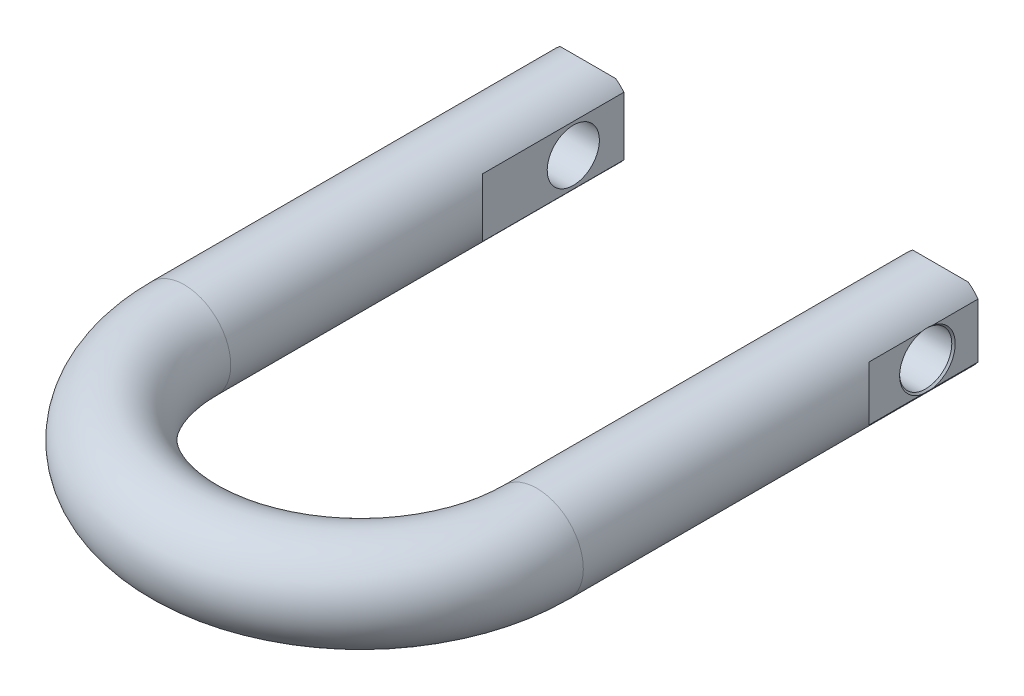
ISO-10303-21;
HEADER;
FILE_DESCRIPTION(('STEP AP214'),'2;1');
FILE_NAME('part.step','',(''),(''),'','','');
FILE_SCHEMA(('AUTOMOTIVE_DESIGN { 1 0 10303 214 1 1 1 1 }'));
ENDSEC;
DATA;
#1=APPLICATION_CONTEXT('core data for automotive mechanical design processes');
#2=APPLICATION_PROTOCOL_DEFINITION('international standard','automotive_design',2000,#1);
#3=PRODUCT_CONTEXT('',#1,'mechanical');
#4=PRODUCT('Part','Part','',(#3));
#5=PRODUCT_RELATED_PRODUCT_CATEGORY('part','',(#4));
#6=PRODUCT_DEFINITION_FORMATION('','',#4);
#7=PRODUCT_DEFINITION_CONTEXT('part definition',#1,'design');
#8=PRODUCT_DEFINITION('design','',#6,#7);
#9=PRODUCT_DEFINITION_SHAPE('','',#8);
#10=(LENGTH_UNIT() NAMED_UNIT(*) SI_UNIT(.MILLI.,.METRE.));
#11=(NAMED_UNIT(*) PLANE_ANGLE_UNIT() SI_UNIT($,.RADIAN.));
#12=(NAMED_UNIT(*) SI_UNIT($,.STERADIAN.) SOLID_ANGLE_UNIT());
#13=UNCERTAINTY_MEASURE_WITH_UNIT(LENGTH_MEASURE(1.E-05),#10,'distance_accuracy_value','');
#14=(GEOMETRIC_REPRESENTATION_CONTEXT(3) GLOBAL_UNCERTAINTY_ASSIGNED_CONTEXT((#13)) GLOBAL_UNIT_ASSIGNED_CONTEXT((#10,
#11,#12)) REPRESENTATION_CONTEXT('',''));
#15=CARTESIAN_POINT('',(0.,0.,0.));
#16=DIRECTION('',(0.,0.,1.));
#17=DIRECTION('',(1.,0.,0.));
#18=AXIS2_PLACEMENT_3D('',#15,#16,#17);
#19=CARTESIAN_POINT('',(72.58685,0.,0.));
#20=DIRECTION('',(-1.,0.,0.));
#21=DIRECTION('',(0.,-1.,0.));
#22=AXIS2_PLACEMENT_3D('',#19,#20,#21);
#23=CYLINDRICAL_SURFACE('',#22,8.9281);
#24=CARTESIAN_POINT('',(48.0314,0.,0.));
#25=DIRECTION('',(-1.,0.,0.));
#26=DIRECTION('',(0.,-1.,0.));
#27=AXIS2_PLACEMENT_3D('',#24,#25,#26);
#28=CIRCLE('',#27,8.9281);
#29=CARTESIAN_POINT('',(48.0314,-8.9281,0.));
#30=VERTEX_POINT('',#29);
#31=EDGE_CURVE('E18',#30,#30,#28,.T.);
#32=ORIENTED_EDGE('',*,*,#31,.T.);
#33=EDGE_LOOP('',(#32));
#34=FACE_BOUND('',#33,.T.);
#35=CARTESIAN_POINT('',(72.58685,0.,0.));
#36=DIRECTION('',(1.,0.,0.));
#37=DIRECTION('',(0.,0.,-1.));
#38=AXIS2_PLACEMENT_3D('',#35,#36,#37);
#39=CIRCLE('',#38,8.9281);
#40=CARTESIAN_POINT('',(72.58685,0.,-8.9281));
#41=VERTEX_POINT('',#40);
#42=EDGE_CURVE('E233',#41,#41,#39,.F.);
#43=ORIENTED_EDGE('',*,*,#42,.F.);
#44=EDGE_LOOP('',(#43));
#45=FACE_BOUND('',#44,.T.);
#46=ADVANCED_FACE('F14',(#34,#45),#23,.F.);
#47=CARTESIAN_POINT('',(-48.0314,0.,0.));
#48=DIRECTION('',(-1.,0.,0.));
#49=DIRECTION('',(0.,-1.,0.));
#50=AXIS2_PLACEMENT_3D('',#47,#48,#49);
#51=CYLINDRICAL_SURFACE('',#50,8.9281);
#52=CARTESIAN_POINT('',(-72.58685,0.,0.));
#53=DIRECTION('',(-1.,0.,0.));
#54=DIRECTION('',(0.,-1.,0.));
#55=AXIS2_PLACEMENT_3D('',#52,#53,#54);
#56=CIRCLE('',#55,8.9281);
#57=CARTESIAN_POINT('',(-72.58685,-8.9281,0.));
#58=VERTEX_POINT('',#57);
#59=EDGE_CURVE('E235',#58,#58,#56,.F.);
#60=ORIENTED_EDGE('',*,*,#59,.F.);
#61=EDGE_LOOP('',(#60));
#62=FACE_BOUND('',#61,.T.);
#63=CARTESIAN_POINT('',(-48.0314,0.,0.));
#64=DIRECTION('',(-1.,0.,0.));
#65=DIRECTION('',(0.,-1.,0.));
#66=AXIS2_PLACEMENT_3D('',#63,#64,#65);
#67=CIRCLE('',#66,8.9281);
#68=CARTESIAN_POINT('',(-48.0314,-8.9281,0.));
#69=VERTEX_POINT('',#68);
#70=EDGE_CURVE('E145',#69,#69,#67,.F.);
#71=ORIENTED_EDGE('',*,*,#70,.T.);
#72=EDGE_LOOP('',(#71));
#73=FACE_BOUND('',#72,.T.);
#74=ADVANCED_FACE('F157',(#62,#73),#51,.F.);
#75=CARTESIAN_POINT('',(0.,0.,120.8151));
#76=DIRECTION('',(0.,-1.,0.));
#77=DIRECTION('',(1.,0.,0.));
#78=AXIS2_PLACEMENT_3D('',#75,#76,#77);
#79=TOROIDAL_SURFACE('',#78,60.3377,15.875);
#80=CARTESIAN_POINT('',(-60.3377,0.,120.8151));
#81=DIRECTION('',(0.,0.,1.));
#82=DIRECTION('',(0.,1.,0.));
#83=AXIS2_PLACEMENT_3D('',#80,#81,#82);
#84=CIRCLE('',#83,15.875);
#85=CARTESIAN_POINT('',(-60.3377,15.875,120.8151));
#86=VERTEX_POINT('',#85);
#87=EDGE_CURVE('E262',#86,#86,#84,.T.);
#88=ORIENTED_EDGE('',*,*,#87,.T.);
#89=EDGE_LOOP('',(#88));
#90=FACE_BOUND('',#89,.T.);
#91=CARTESIAN_POINT('',(60.3377,0.,120.8151));
#92=DIRECTION('',(0.,0.,1.));
#93=DIRECTION('',(0.,1.,0.));
#94=AXIS2_PLACEMENT_3D('',#91,#92,#93);
#95=CIRCLE('',#94,15.875);
#96=CARTESIAN_POINT('',(60.3377,15.875,120.8151));
#97=VERTEX_POINT('',#96);
#98=EDGE_CURVE('E266',#97,#97,#95,.T.);
#99=ORIENTED_EDGE('',*,*,#98,.T.);
#100=EDGE_LOOP('',(#99));
#101=FACE_BOUND('',#100,.T.);
#102=ADVANCED_FACE('F16',(#90,#101),#79,.T.);
#103=CARTESIAN_POINT('',(-50.6984,12.7,-17.3101));
#104=DIRECTION('',(0.,-0.707106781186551,0.707106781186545));
#105=DIRECTION('',(0.,0.707106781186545,0.70710678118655));
#106=AXIS2_PLACEMENT_3D('',#103,#104,#105);
#107=PLANE('',#106);
#108=DIRECTION('',(-1.,0.,0.));
#109=VECTOR('',#108,1.);
#110=CARTESIAN_POINT('',(-60.6044,12.7,-17.3101));
#111=LINE('',#110,#109);
#112=CARTESIAN_POINT('',(-50.8127,12.7,-17.3101));
#113=VERTEX_POINT('',#112);
#114=CARTESIAN_POINT('',(-69.8627,12.7,-17.3101));
#115=VERTEX_POINT('',#114);
#116=EDGE_CURVE('E243',#113,#115,#111,.T.);
#117=ORIENTED_EDGE('',*,*,#116,.T.);
#118=CARTESIAN_POINT('',(-60.3377,0.,-30.0101));
#119=DIRECTION('',(0.,-0.707106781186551,0.707106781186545));
#120=DIRECTION('',(0.,-0.707106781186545,-0.707106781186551));
#121=AXIS2_PLACEMENT_3D('',#118,#119,#120);
#122=ELLIPSE('',#121,22.450640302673,15.875);
#123=EDGE_CURVE('E289',#115,#113,#122,.F.);
#124=ORIENTED_EDGE('',*,*,#123,.T.);
#125=EDGE_LOOP('',(#117,#124));
#126=FACE_BOUND('',#125,.T.);
#127=ADVANCED_FACE('F370',(#126),#107,.F.);
#128=CARTESIAN_POINT('',(-48.0314,-10.1488315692,31.1023));
#129=DIRECTION('',(-0.707106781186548,0.,0.707106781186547));
#130=DIRECTION('',(0.707106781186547,0.,0.707106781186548));
#131=AXIS2_PLACEMENT_3D('',#128,#129,#130);
#132=PLANE('',#131);
#133=DIRECTION('',(0.,-1.,0.));
#134=VECTOR('',#133,1.);
#135=CARTESIAN_POINT('',(-48.0314,0.,31.1023));
#136=LINE('',#135,#134);
#137=CARTESIAN_POINT('',(-48.0314000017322,10.0284896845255,31.1022999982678));
#138=VERTEX_POINT('',#137);
#139=CARTESIAN_POINT('',(-48.0314000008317,-10.0284896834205,31.1022999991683));
#140=VERTEX_POINT('',#139);
#141=EDGE_CURVE('E144',#138,#140,#136,.T.);
#142=ORIENTED_EDGE('',*,*,#141,.F.);
#143=CARTESIAN_POINT('',(-60.3377,0.,18.796));
#144=DIRECTION('',(-0.707106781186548,0.,0.707106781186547));
#145=DIRECTION('',(-0.707106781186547,0.,-0.707106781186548));
#146=AXIS2_PLACEMENT_3D('',#143,#144,#145);
#147=ELLIPSE('',#146,22.4506403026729,15.875);
#148=EDGE_CURVE('E255',#138,#140,#147,.F.);
#149=ORIENTED_EDGE('',*,*,#148,.T.);
#150=EDGE_LOOP('',(#142,#149));
#151=FACE_BOUND('',#150,.T.);
#152=ADVANCED_FACE('F377',(#151),#132,.F.);
#153=CARTESIAN_POINT('',(-48.0314,-10.0284896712,-17.3101));
#154=DIRECTION('',(-1.,0.,0.));
#155=DIRECTION('',(0.,0.,1.));
#156=AXIS2_PLACEMENT_3D('',#153,#154,#155);
#157=PLANE('',#156);
#158=ORIENTED_EDGE('',*,*,#70,.F.);
#159=EDGE_LOOP('',(#158));
#160=FACE_BOUND('',#159,.T.);
#161=DIRECTION('',(0.,-1.,0.));
#162=VECTOR('',#161,1.);
#163=CARTESIAN_POINT('',(-48.0314,0.,-17.3101));
#164=LINE('',#163,#162);
#165=CARTESIAN_POINT('',(-48.0314000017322,10.0284896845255,-17.3101));
#166=VERTEX_POINT('',#165);
#167=CARTESIAN_POINT('',(-48.0314000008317,-10.0284896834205,-17.3101));
#168=VERTEX_POINT('',#167);
#169=EDGE_CURVE('E245',#166,#168,#164,.T.);
#170=ORIENTED_EDGE('',*,*,#169,.F.);
#171=DIRECTION('',(0.,0.,-1.));
#172=VECTOR('',#171,1.);
#173=CARTESIAN_POINT('',(-48.0314000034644,10.0284896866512,51.7525));
#174=LINE('',#173,#172);
#175=EDGE_CURVE('E253',#166,#138,#174,.F.);
#176=ORIENTED_EDGE('',*,*,#175,.T.);
#177=ORIENTED_EDGE('',*,*,#141,.T.);
#178=DIRECTION('',(0.,0.,1.));
#179=VECTOR('',#178,1.);
#180=CARTESIAN_POINT('',(-48.0314000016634,-10.0284896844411,51.7525));
#181=LINE('',#180,#179);
#182=EDGE_CURVE('E278',#140,#168,#181,.F.);
#183=ORIENTED_EDGE('',*,*,#182,.T.);
#184=EDGE_LOOP('',(#170,#176,#177,#183));
#185=FACE_BOUND('',#184,.T.);
#186=ADVANCED_FACE('F307',(#160,#185),#157,.F.);
#187=CARTESIAN_POINT('',(-50.6984,-15.89405,-14.11605));
#188=DIRECTION('',(0.,0.707106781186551,0.707106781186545));
#189=DIRECTION('',(0.,0.707106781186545,-0.70710678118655));
#190=AXIS2_PLACEMENT_3D('',#187,#188,#189);
#191=PLANE('',#190);
#192=DIRECTION('',(1.,0.,0.));
#193=VECTOR('',#192,1.);
#194=CARTESIAN_POINT('',(-60.6044,-12.7,-17.3101));
#195=LINE('',#194,#193);
#196=CARTESIAN_POINT('',(-69.8627,-12.7,-17.3101));
#197=VERTEX_POINT('',#196);
#198=CARTESIAN_POINT('',(-50.8127,-12.7,-17.3101));
#199=VERTEX_POINT('',#198);
#200=EDGE_CURVE('E246',#197,#199,#195,.T.);
#201=ORIENTED_EDGE('',*,*,#200,.T.);
#202=CARTESIAN_POINT('',(-60.3377,0.,-30.0101));
#203=DIRECTION('',(0.,0.707106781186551,0.707106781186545));
#204=DIRECTION('',(0.,0.707106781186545,-0.707106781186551));
#205=AXIS2_PLACEMENT_3D('',#202,#203,#204);
#206=ELLIPSE('',#205,22.450640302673,15.875);
#207=EDGE_CURVE('E313',#199,#197,#206,.F.);
#208=ORIENTED_EDGE('',*,*,#207,.T.);
#209=EDGE_LOOP('',(#201,#208));
#210=FACE_BOUND('',#209,.T.);
#211=ADVANCED_FACE('F390',(#210),#191,.F.);
#212=CARTESIAN_POINT('',(-73.1774,-12.7,-17.3101));
#213=DIRECTION('',(0.,0.,1.));
#214=DIRECTION('',(1.,0.,0.));
#215=AXIS2_PLACEMENT_3D('',#212,#213,#214);
#216=PLANE('',#215);
#217=CARTESIAN_POINT('',(-60.3377,0.,-17.3101));
#218=DIRECTION('',(0.,0.,-1.));
#219=DIRECTION('',(0.,-1.,0.));
#220=AXIS2_PLACEMENT_3D('',#217,#218,#219);
#221=CIRCLE('',#220,15.875);
#222=EDGE_CURVE('E256',#113,#166,#221,.T.);
#223=ORIENTED_EDGE('',*,*,#222,.T.);
#224=ORIENTED_EDGE('',*,*,#169,.T.);
#225=CARTESIAN_POINT('',(-60.3377,0.,-17.3101));
#226=DIRECTION('',(0.,0.,-1.));
#227=DIRECTION('',(0.,-1.,0.));
#228=AXIS2_PLACEMENT_3D('',#225,#226,#227);
#229=CIRCLE('',#228,15.875);
#230=EDGE_CURVE('E281',#168,#199,#229,.T.);
#231=ORIENTED_EDGE('',*,*,#230,.T.);
#232=ORIENTED_EDGE('',*,*,#200,.F.);
#233=CARTESIAN_POINT('',(-60.3377,0.,-17.3101));
#234=DIRECTION('',(0.,0.,-1.));
#235=DIRECTION('',(0.,-1.,0.));
#236=AXIS2_PLACEMENT_3D('',#233,#234,#235);
#237=CIRCLE('',#236,15.875);
#238=CARTESIAN_POINT('',(-73.1773999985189,-9.33583038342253,-17.3101));
#239=VERTEX_POINT('',#238);
#240=EDGE_CURVE('E190',#197,#239,#237,.T.);
#241=ORIENTED_EDGE('',*,*,#240,.T.);
#242=DIRECTION('',(0.,-1.,0.));
#243=VECTOR('',#242,1.);
#244=CARTESIAN_POINT('',(-73.1774,0.,-17.3101));
#245=LINE('',#244,#243);
#246=CARTESIAN_POINT('',(-73.1773999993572,9.3358303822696,-17.3101));
#247=VERTEX_POINT('',#246);
#248=EDGE_CURVE('E248',#247,#239,#245,.T.);
#249=ORIENTED_EDGE('',*,*,#248,.F.);
#250=CARTESIAN_POINT('',(-60.3377,0.,-17.3101));
#251=DIRECTION('',(0.,0.,-1.));
#252=DIRECTION('',(0.,-1.,0.));
#253=AXIS2_PLACEMENT_3D('',#250,#251,#252);
#254=CIRCLE('',#253,15.875);
#255=EDGE_CURVE('E209',#247,#115,#254,.T.);
#256=ORIENTED_EDGE('',*,*,#255,.T.);
#257=ORIENTED_EDGE('',*,*,#116,.F.);
#258=EDGE_LOOP('',(#223,#224,#231,#232,#241,#249,#256,#257));
#259=FACE_BOUND('',#258,.T.);
#260=ADVANCED_FACE('F297',(#259),#216,.F.);
#261=CARTESIAN_POINT('',(-73.1774,-9.3358303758,-1.7638804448));
#262=DIRECTION('',(1.,0.,0.));
#263=DIRECTION('',(0.,0.,-1.));
#264=AXIS2_PLACEMENT_3D('',#261,#262,#263);
#265=PLANE('',#264);
#266=ORIENTED_EDGE('',*,*,#248,.T.);
#267=DIRECTION('',(0.,0.,-1.));
#268=VECTOR('',#267,1.);
#269=CARTESIAN_POINT('',(-73.1774,-9.33583038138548,120.8151));
#270=LINE('',#269,#268);
#271=CARTESIAN_POINT('',(-73.1774,-9.33583038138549,-1.85660144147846));
#272=VERTEX_POINT('',#271);
#273=EDGE_CURVE('E265',#272,#239,#270,.T.);
#274=ORIENTED_EDGE('',*,*,#273,.F.);
#275=CARTESIAN_POINT('',(-73.1774,0.,0.));
#276=DIRECTION('',(-1.,0.,0.));
#277=DIRECTION('',(0.,-1.,0.));
#278=AXIS2_PLACEMENT_3D('',#275,#276,#277);
#279=CIRCLE('',#278,9.51865);
#280=CARTESIAN_POINT('',(-73.1773999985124,9.33583038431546,-1.8566014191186));
#281=VERTEX_POINT('',#280);
#282=EDGE_CURVE('E260',#281,#272,#279,.T.);
#283=ORIENTED_EDGE('',*,*,#282,.F.);
#284=DIRECTION('',(0.,0.,1.));
#285=VECTOR('',#284,1.);
#286=CARTESIAN_POINT('',(-73.1773999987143,9.33583038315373,51.7525));
#287=LINE('',#286,#285);
#288=EDGE_CURVE('E258',#281,#247,#287,.F.);
#289=ORIENTED_EDGE('',*,*,#288,.T.);
#290=EDGE_LOOP('',(#266,#274,#283,#289));
#291=FACE_BOUND('',#290,.T.);
#292=ADVANCED_FACE('F322',(#291),#265,.F.);
#293=CARTESIAN_POINT('',(-72.58685,0.,0.));
#294=DIRECTION('',(-1.,0.,0.));
#295=DIRECTION('',(0.,-1.,0.));
#296=AXIS2_PLACEMENT_3D('',#293,#294,#295);
#297=CONICAL_SURFACE('',#296,8.9281,0.785398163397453);
#298=CARTESIAN_POINT('',(-73.1774,0.,0.));
#299=DIRECTION('',(-1.,0.,0.));
#300=DIRECTION('',(0.,0.,1.));
#301=AXIS2_PLACEMENT_3D('',#298,#299,#300);
#302=CIRCLE('',#301,9.51865);
#303=CARTESIAN_POINT('',(-73.1774,9.33583038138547,1.85660144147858));
#304=VERTEX_POINT('',#303);
#305=CARTESIAN_POINT('',(-73.1774,-9.33583038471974,1.85660142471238));
#306=VERTEX_POINT('',#305);
#307=EDGE_CURVE('E329',#304,#306,#302,.F.);
#308=ORIENTED_EDGE('',*,*,#307,.F.);
#309=CARTESIAN_POINT('',(-73.1773999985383,9.33583038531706,1.85660140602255));
#310=CARTESIAN_POINT('',(-73.1646022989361,9.35342768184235,1.70251337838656));
#311=CARTESIAN_POINT('',(-73.153350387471,9.3688305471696,1.54805732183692));
#312=CARTESIAN_POINT('',(-73.1340063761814,9.39523539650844,1.23857054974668));
#313=CARTESIAN_POINT('',(-73.1259143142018,9.40623732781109,1.08353982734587));
#314=CARTESIAN_POINT('',(-73.10654646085,9.43253380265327,0.619410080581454));
#315=CARTESIAN_POINT('',(-73.1000477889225,9.44129778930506,0.309705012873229));
#316=CARTESIAN_POINT('',(-73.1000477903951,9.44129778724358,-0.309705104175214));
#317=CARTESIAN_POINT('',(-73.1065464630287,9.43253379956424,-0.619410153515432));
#318=CARTESIAN_POINT('',(-73.1259143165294,9.40623732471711,-1.08353987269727));
#319=CARTESIAN_POINT('',(-73.1340063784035,9.39523539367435,-1.23857058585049));
#320=CARTESIAN_POINT('',(-73.1533503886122,9.36883054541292,-1.54805733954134));
#321=CARTESIAN_POINT('',(-73.1646022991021,9.35342768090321,-1.70251338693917));
#322=CARTESIAN_POINT('',(-73.1773999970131,9.33583038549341,-1.85660140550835));
#323=B_SPLINE_CURVE_WITH_KNOTS('',3,(#309,#310,#311,#312,#313,#314,#315,#316,#317,#318,#319,
#320,#321,#322),.UNSPECIFIED.,.F.,.F.,(4,2,2,2,2,2,4),(0.,0.466804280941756,0.933614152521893,
1.86249240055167,2.79137059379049,3.25818043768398,3.72498469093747),.UNSPECIFIED.);
#324=EDGE_CURVE('E202',#304,#281,#323,.T.);
#325=ORIENTED_EDGE('',*,*,#324,.T.);
#326=ORIENTED_EDGE('',*,*,#282,.T.);
#327=CARTESIAN_POINT('',(-73.1773999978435,-9.33583038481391,-1.8566014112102));
#328=CARTESIAN_POINT('',(-73.1646022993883,-9.35342768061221,-1.70251338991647));
#329=CARTESIAN_POINT('',(-73.1533503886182,-9.36883054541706,-1.54805733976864));
#330=CARTESIAN_POINT('',(-73.1340063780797,-9.39523539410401,-1.23857058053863));
#331=CARTESIAN_POINT('',(-73.1259143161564,-9.40623732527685,-1.0835398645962));
#332=CARTESIAN_POINT('',(-73.1065464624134,-9.43253380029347,-0.619410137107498));
#333=CARTESIAN_POINT('',(-73.1000477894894,-9.44129778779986,-0.309705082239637));
#334=CARTESIAN_POINT('',(-73.1000477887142,-9.44129778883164,0.309705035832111));
#335=CARTESIAN_POINT('',(-73.1065464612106,-9.43253380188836,0.619410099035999));
#336=CARTESIAN_POINT('',(-73.1259143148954,-9.40623732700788,1.08353983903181));
#337=CARTESIAN_POINT('',(-73.1340063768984,-9.39523539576,1.23857055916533));
#338=CARTESIAN_POINT('',(-73.1533503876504,-9.36883054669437,1.54805732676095));
#339=CARTESIAN_POINT('',(-73.1646022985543,-9.35342768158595,1.70251338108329));
#340=CARTESIAN_POINT('',(-73.1773999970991,-9.33583038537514,1.85660140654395));
#341=B_SPLINE_CURVE_WITH_KNOTS('',3,(#327,#328,#329,#330,#331,#332,#333,#334,#335,#336,#337,
#338,#339,#340),.UNSPECIFIED.,.F.,.F.,(4,2,2,2,2,2,4),(0.,0.466804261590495,0.933614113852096,
1.86249232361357,2.79137055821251,3.25818042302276,3.72498469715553),.UNSPECIFIED.);
#342=EDGE_CURVE('E183',#272,#306,#341,.T.);
#343=ORIENTED_EDGE('',*,*,#342,.T.);
#344=EDGE_LOOP('',(#308,#325,#326,#343));
#345=FACE_BOUND('',#344,.T.);
#346=ORIENTED_EDGE('',*,*,#59,.T.);
#347=EDGE_LOOP('',(#346));
#348=FACE_BOUND('',#347,.T.);
#349=ADVANCED_FACE('F159',(#345,#348),#297,.F.);
#350=CARTESIAN_POINT('',(-73.1774,-9.3358303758,19.9771));
#351=DIRECTION('',(1.,0.,0.));
#352=DIRECTION('',(0.,0.,-1.));
#353=AXIS2_PLACEMENT_3D('',#350,#351,#352);
#354=PLANE('',#353);
#355=DIRECTION('',(0.,-1.,0.));
#356=VECTOR('',#355,1.);
#357=CARTESIAN_POINT('',(-73.1774,0.,19.9771));
#358=LINE('',#357,#356);
#359=CARTESIAN_POINT('',(-73.1773999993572,9.3358303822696,19.9770999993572));
#360=VERTEX_POINT('',#359);
#361=CARTESIAN_POINT('',(-73.1773999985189,-9.33583038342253,19.9770999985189));
#362=VERTEX_POINT('',#361);
#363=EDGE_CURVE('E232',#360,#362,#358,.T.);
#364=ORIENTED_EDGE('',*,*,#363,.F.);
#365=DIRECTION('',(0.,0.,-1.));
#366=VECTOR('',#365,1.);
#367=CARTESIAN_POINT('',(-73.1774,9.33583038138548,120.8151));
#368=LINE('',#367,#366);
#369=EDGE_CURVE('E335',#304,#360,#368,.F.);
#370=ORIENTED_EDGE('',*,*,#369,.F.);
#371=ORIENTED_EDGE('',*,*,#307,.T.);
#372=EDGE_CURVE('E259',#362,#306,#270,.T.);
#373=ORIENTED_EDGE('',*,*,#372,.F.);
#374=EDGE_LOOP('',(#364,#370,#371,#373));
#375=FACE_BOUND('',#374,.T.);
#376=ADVANCED_FACE('F404',(#375),#354,.F.);
#377=CARTESIAN_POINT('',(-76.2309118,-9.4478603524,23.0306118));
#378=DIRECTION('',(0.707106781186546,0.,0.707106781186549));
#379=DIRECTION('',(0.707106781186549,0.,-0.707106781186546));
#380=AXIS2_PLACEMENT_3D('',#377,#378,#379);
#381=PLANE('',#380);
#382=ORIENTED_EDGE('',*,*,#363,.T.);
#383=CARTESIAN_POINT('',(-60.3377,0.,7.1374));
#384=DIRECTION('',(0.707106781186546,0.,0.707106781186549));
#385=DIRECTION('',(0.707106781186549,0.,-0.707106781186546));
#386=AXIS2_PLACEMENT_3D('',#383,#384,#385);
#387=ELLIPSE('',#386,22.4506403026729,15.875);
#388=EDGE_CURVE('E210',#362,#360,#387,.F.);
#389=ORIENTED_EDGE('',*,*,#388,.T.);
#390=EDGE_LOOP('',(#382,#389));
#391=FACE_BOUND('',#390,.T.);
#392=ADVANCED_FACE('F197',(#391),#381,.F.);
#393=CARTESIAN_POINT('',(-60.3377,0.,120.8151));
#394=DIRECTION('',(0.,0.,-1.));
#395=DIRECTION('',(0.,-1.,0.));
#396=AXIS2_PLACEMENT_3D('',#393,#394,#395);
#397=CYLINDRICAL_SURFACE('',#396,15.875);
#398=ORIENTED_EDGE('',*,*,#388,.F.);
#399=ORIENTED_EDGE('',*,*,#372,.T.);
#400=ORIENTED_EDGE('',*,*,#342,.F.);
#401=ORIENTED_EDGE('',*,*,#273,.T.);
#402=ORIENTED_EDGE('',*,*,#240,.F.);
#403=ORIENTED_EDGE('',*,*,#207,.F.);
#404=ORIENTED_EDGE('',*,*,#230,.F.);
#405=ORIENTED_EDGE('',*,*,#182,.F.);
#406=ORIENTED_EDGE('',*,*,#148,.F.);
#407=ORIENTED_EDGE('',*,*,#175,.F.);
#408=ORIENTED_EDGE('',*,*,#222,.F.);
#409=ORIENTED_EDGE('',*,*,#123,.F.);
#410=ORIENTED_EDGE('',*,*,#255,.F.);
#411=ORIENTED_EDGE('',*,*,#288,.F.);
#412=ORIENTED_EDGE('',*,*,#324,.F.);
#413=ORIENTED_EDGE('',*,*,#369,.T.);
#414=EDGE_LOOP('',(#398,#399,#400,#401,#402,#403,#404,#405,#406,#407,#408,#409,#410,#411,#412,#413));
#415=FACE_BOUND('',#414,.T.);
#416=ORIENTED_EDGE('',*,*,#87,.F.);
#417=EDGE_LOOP('',(#416));
#418=FACE_BOUND('',#417,.T.);
#419=ADVANCED_FACE('F192',(#415,#418),#397,.T.);
#420=CARTESIAN_POINT('',(69.977,12.7,-17.3101));
#421=DIRECTION('',(0.,-0.707106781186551,0.707106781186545));
#422=DIRECTION('',(0.,0.707106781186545,0.70710678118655));
#423=AXIS2_PLACEMENT_3D('',#420,#421,#422);
#424=PLANE('',#423);
#425=CARTESIAN_POINT('',(60.3377,0.,-30.0101));
#426=DIRECTION('',(0.,-0.707106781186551,0.707106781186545));
#427=DIRECTION('',(0.,-0.707106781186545,-0.707106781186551));
#428=AXIS2_PLACEMENT_3D('',#425,#426,#427);
#429=ELLIPSE('',#428,22.450640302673,15.875);
#430=CARTESIAN_POINT('',(50.8127,12.7,-17.3101));
#431=VERTEX_POINT('',#430);
#432=CARTESIAN_POINT('',(69.8627,12.7,-17.3101));
#433=VERTEX_POINT('',#432);
#434=EDGE_CURVE('E175',#431,#433,#429,.F.);
#435=ORIENTED_EDGE('',*,*,#434,.T.);
#436=DIRECTION('',(1.,0.,0.));
#437=VECTOR('',#436,1.);
#438=CARTESIAN_POINT('',(60.6044,12.7,-17.3101));
#439=LINE('',#438,#437);
#440=EDGE_CURVE('E116',#431,#433,#439,.T.);
#441=ORIENTED_EDGE('',*,*,#440,.F.);
#442=EDGE_LOOP('',(#435,#441));
#443=FACE_BOUND('',#442,.T.);
#444=ADVANCED_FACE('F196',(#443),#424,.F.);
#445=CARTESIAN_POINT('',(73.1774,-9.4478603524,19.9771));
#446=DIRECTION('',(-0.707106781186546,0.,0.707106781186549));
#447=DIRECTION('',(0.707106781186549,0.,0.707106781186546));
#448=AXIS2_PLACEMENT_3D('',#445,#446,#447);
#449=PLANE('',#448);
#450=DIRECTION('',(0.,-1.,0.));
#451=VECTOR('',#450,1.);
#452=CARTESIAN_POINT('',(73.1774,0.,19.9771));
#453=LINE('',#452,#451);
#454=CARTESIAN_POINT('',(73.177400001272,9.33583037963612,19.977100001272));
#455=VERTEX_POINT('',#454);
#456=CARTESIAN_POINT('',(73.1774000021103,-9.3358303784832,19.9771000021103));
#457=VERTEX_POINT('',#456);
#458=EDGE_CURVE('E223',#455,#457,#453,.T.);
#459=ORIENTED_EDGE('',*,*,#458,.F.);
#460=CARTESIAN_POINT('',(60.3377,0.,7.1374));
#461=DIRECTION('',(-0.707106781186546,0.,0.707106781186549));
#462=DIRECTION('',(-0.707106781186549,0.,-0.707106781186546));
#463=AXIS2_PLACEMENT_3D('',#460,#461,#462);
#464=ELLIPSE('',#463,22.4506403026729,15.875);
#465=EDGE_CURVE('E171',#455,#457,#464,.F.);
#466=ORIENTED_EDGE('',*,*,#465,.T.);
#467=EDGE_LOOP('',(#459,#466));
#468=FACE_BOUND('',#467,.T.);
#469=ADVANCED_FACE('F222',(#468),#449,.F.);
#470=CARTESIAN_POINT('',(73.1774,9.3358303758,1.74787844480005));
#471=DIRECTION('',(-1.,0.,0.));
#472=DIRECTION('',(0.,-1.,0.));
#473=AXIS2_PLACEMENT_3D('',#470,#471,#472);
#474=PLANE('',#473);
#475=ORIENTED_EDGE('',*,*,#458,.T.);
#476=DIRECTION('',(0.,0.,1.));
#477=VECTOR('',#476,1.);
#478=CARTESIAN_POINT('',(73.1774000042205,-9.33583037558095,51.7525));
#479=LINE('',#478,#477);
#480=CARTESIAN_POINT('',(73.1774000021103,-9.33583037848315,1.85660146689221));
#481=VERTEX_POINT('',#480);
#482=EDGE_CURVE('E9',#457,#481,#479,.F.);
#483=ORIENTED_EDGE('',*,*,#482,.T.);
#484=CARTESIAN_POINT('',(73.1774,0.,0.));
#485=DIRECTION('',(1.,0.,0.));
#486=DIRECTION('',(0.,1.,0.));
#487=AXIS2_PLACEMENT_3D('',#484,#485,#486);
#488=CIRCLE('',#487,9.51865);
#489=CARTESIAN_POINT('',(73.1774000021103,9.33583037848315,1.8566014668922));
#490=VERTEX_POINT('',#489);
#491=EDGE_CURVE('E24',#490,#481,#488,.T.);
#492=ORIENTED_EDGE('',*,*,#491,.F.);
#493=DIRECTION('',(0.,0.,-1.));
#494=VECTOR('',#493,1.);
#495=CARTESIAN_POINT('',(73.1774,9.33583038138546,120.8151));
#496=LINE('',#495,#494);
#497=EDGE_CURVE('E231',#455,#490,#496,.T.);
#498=ORIENTED_EDGE('',*,*,#497,.F.);
#499=EDGE_LOOP('',(#475,#483,#492,#498));
#500=FACE_BOUND('',#499,.T.);
#501=ADVANCED_FACE('F155',(#500),#474,.F.);
#502=CARTESIAN_POINT('',(72.58685,0.,0.));
#503=DIRECTION('',(1.,0.,0.));
#504=DIRECTION('',(0.,1.,0.));
#505=AXIS2_PLACEMENT_3D('',#502,#503,#504);
#506=CONICAL_SURFACE('',#505,8.9281,0.785398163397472);
#507=ORIENTED_EDGE('',*,*,#42,.T.);
#508=EDGE_LOOP('',(#507));
#509=FACE_BOUND('',#508,.T.);
#510=CARTESIAN_POINT('',(73.1774000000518,9.33583038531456,-1.85660140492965));
#511=CARTESIAN_POINT('',(73.1646022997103,9.35342768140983,-1.70251338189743));
#512=CARTESIAN_POINT('',(73.1533503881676,9.36883054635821,-1.5480573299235));
#513=CARTESIAN_POINT('',(73.134006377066,9.39523539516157,-1.23857056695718));
#514=CARTESIAN_POINT('',(73.1259143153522,9.40623732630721,-1.08353984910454));
#515=CARTESIAN_POINT('',(73.1065464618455,9.43253380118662,-0.61941011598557));
#516=CARTESIAN_POINT('',(73.100047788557,9.44129778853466,-0.30970505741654));
#517=CARTESIAN_POINT('',(73.1000477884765,9.44129778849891,0.309705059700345));
#518=CARTESIAN_POINT('',(73.1065464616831,9.43253380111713,0.619410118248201));
#519=CARTESIAN_POINT('',(73.1259143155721,9.40623732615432,1.08353985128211));
#520=CARTESIAN_POINT('',(73.1340063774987,9.39523539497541,1.23857056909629));
#521=CARTESIAN_POINT('',(73.1533503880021,9.36883054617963,1.54805733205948));
#522=CARTESIAN_POINT('',(73.1646022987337,9.35342768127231,1.70251338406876));
#523=CARTESIAN_POINT('',(73.1773999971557,9.33583038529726,1.85660140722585));
#524=B_SPLINE_CURVE_WITH_KNOTS('',3,(#510,#511,#512,#513,#514,#515,#516,#517,#518,#519,#520,
#521,#522,#523),.UNSPECIFIED.,.F.,.F.,(4,2,2,2,2,2,4),(0.,0.466804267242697,0.933614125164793,
1.86249234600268,2.79137056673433,3.25818042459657,3.72498469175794),.UNSPECIFIED.);
#525=CARTESIAN_POINT('',(73.1774000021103,9.33583037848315,-1.8566014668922));
#526=VERTEX_POINT('',#525);
#527=EDGE_CURVE('E163',#526,#490,#524,.T.);
#528=ORIENTED_EDGE('',*,*,#527,.T.);
#529=ORIENTED_EDGE('',*,*,#491,.T.);
#530=CARTESIAN_POINT('',(73.1774000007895,-9.33583038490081,1.8566014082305));
#531=CARTESIAN_POINT('',(73.1646023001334,-9.35342768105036,1.70251338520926));
#532=CARTESIAN_POINT('',(73.1533503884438,-9.3688305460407,1.54805733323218));
#533=CARTESIAN_POINT('',(73.1340063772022,-9.39523539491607,1.23857057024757));
#534=CARTESIAN_POINT('',(73.1259143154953,-9.4062373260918,1.08353985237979));
#535=CARTESIAN_POINT('',(73.1065464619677,-9.43253380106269,0.619410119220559));
#536=CARTESIAN_POINT('',(73.1000477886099,-9.44129778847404,0.309705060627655));
#537=CARTESIAN_POINT('',(73.1000477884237,-9.44129778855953,-0.309705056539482));
#538=CARTESIAN_POINT('',(73.1065464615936,-9.43253380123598,-0.619410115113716));
#539=CARTESIAN_POINT('',(73.1259143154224,-9.40623732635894,-1.08353984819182));
#540=CARTESIAN_POINT('',(73.1340063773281,-9.39523539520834,-1.23857056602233));
#541=CARTESIAN_POINT('',(73.1533503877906,-9.36883054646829,-1.54805732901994));
#542=CARTESIAN_POINT('',(73.1646022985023,-9.35342768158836,-1.70251338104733));
#543=CARTESIAN_POINT('',(73.1773999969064,-9.33583038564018,-1.85660140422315));
#544=B_SPLINE_CURVE_WITH_KNOTS('',3,(#530,#531,#532,#533,#534,#535,#536,#537,#538,#539,#540,
#541,#542,#543),.UNSPECIFIED.,.F.,.F.,(4,2,2,2,2,2,4),(0.,0.466804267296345,0.933614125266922,
1.86249234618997,2.79137056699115,3.25818042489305,3.72498469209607),.UNSPECIFIED.);
#545=CARTESIAN_POINT('',(73.1774,-9.33583038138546,-1.85660144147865));
#546=VERTEX_POINT('',#545);
#547=EDGE_CURVE('E125',#481,#546,#544,.T.);
#548=ORIENTED_EDGE('',*,*,#547,.T.);
#549=CARTESIAN_POINT('',(73.1774,0.,0.));
#550=DIRECTION('',(1.,0.,0.));
#551=DIRECTION('',(0.,0.,-1.));
#552=AXIS2_PLACEMENT_3D('',#549,#550,#551);
#553=CIRCLE('',#552,9.51865);
#554=EDGE_CURVE('E33',#526,#546,#553,.F.);
#555=ORIENTED_EDGE('',*,*,#554,.F.);
#556=EDGE_LOOP('',(#528,#529,#548,#555));
#557=FACE_BOUND('',#556,.T.);
#558=ADVANCED_FACE('F150',(#509,#557),#506,.F.);
#559=CARTESIAN_POINT('',(73.1774,9.3358303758,-17.3101));
#560=DIRECTION('',(-1.,0.,0.));
#561=DIRECTION('',(0.,-1.,0.));
#562=AXIS2_PLACEMENT_3D('',#559,#560,#561);
#563=PLANE('',#562);
#564=DIRECTION('',(0.,-1.,0.));
#565=VECTOR('',#564,1.);
#566=CARTESIAN_POINT('',(73.1774,0.,-17.3101));
#567=LINE('',#566,#565);
#568=CARTESIAN_POINT('',(73.177400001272,9.33583037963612,-17.3101));
#569=VERTEX_POINT('',#568);
#570=CARTESIAN_POINT('',(73.1774000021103,-9.3358303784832,-17.3101));
#571=VERTEX_POINT('',#570);
#572=EDGE_CURVE('E115',#569,#571,#567,.T.);
#573=ORIENTED_EDGE('',*,*,#572,.F.);
#574=EDGE_CURVE('E337',#526,#569,#496,.T.);
#575=ORIENTED_EDGE('',*,*,#574,.F.);
#576=ORIENTED_EDGE('',*,*,#554,.T.);
#577=DIRECTION('',(0.,0.,1.));
#578=VECTOR('',#577,1.);
#579=CARTESIAN_POINT('',(73.1774000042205,-9.33583037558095,51.7525));
#580=LINE('',#579,#578);
#581=EDGE_CURVE('E284',#546,#571,#580,.F.);
#582=ORIENTED_EDGE('',*,*,#581,.T.);
#583=EDGE_LOOP('',(#573,#575,#576,#582));
#584=FACE_BOUND('',#583,.T.);
#585=ADVANCED_FACE('F154',(#584),#563,.F.);
#586=CARTESIAN_POINT('',(69.977,-15.89405,-14.11605));
#587=DIRECTION('',(0.,0.707106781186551,0.707106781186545));
#588=DIRECTION('',(0.,0.707106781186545,-0.70710678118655));
#589=AXIS2_PLACEMENT_3D('',#586,#587,#588);
#590=PLANE('',#589);
#591=CARTESIAN_POINT('',(60.3377,0.,-30.0101));
#592=DIRECTION('',(0.,0.707106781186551,0.707106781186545));
#593=DIRECTION('',(0.,0.707106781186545,-0.707106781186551));
#594=AXIS2_PLACEMENT_3D('',#591,#592,#593);
#595=ELLIPSE('',#594,22.450640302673,15.875);
#596=CARTESIAN_POINT('',(69.8627,-12.7,-17.3101));
#597=VERTEX_POINT('',#596);
#598=CARTESIAN_POINT('',(50.8127,-12.7,-17.3101));
#599=VERTEX_POINT('',#598);
#600=EDGE_CURVE('E111',#597,#599,#595,.F.);
#601=ORIENTED_EDGE('',*,*,#600,.T.);
#602=DIRECTION('',(-1.,0.,0.));
#603=VECTOR('',#602,1.);
#604=CARTESIAN_POINT('',(60.6044,-12.7,-17.3101));
#605=LINE('',#604,#603);
#606=EDGE_CURVE('E107',#597,#599,#605,.T.);
#607=ORIENTED_EDGE('',*,*,#606,.F.);
#608=EDGE_LOOP('',(#601,#607));
#609=FACE_BOUND('',#608,.T.);
#610=ADVANCED_FACE('F109',(#609),#590,.F.);
#611=CARTESIAN_POINT('',(73.1774,-12.7,-17.3101));
#612=DIRECTION('',(0.,0.,-1.));
#613=DIRECTION('',(-1.,0.,0.));
#614=AXIS2_PLACEMENT_3D('',#611,#612,#613);
#615=PLANE('',#614);
#616=ORIENTED_EDGE('',*,*,#606,.T.);
#617=CARTESIAN_POINT('',(60.3377,0.,-17.3101));
#618=DIRECTION('',(0.,0.,-1.));
#619=DIRECTION('',(0.,-1.,0.));
#620=AXIS2_PLACEMENT_3D('',#617,#618,#619);
#621=CIRCLE('',#620,15.875);
#622=CARTESIAN_POINT('',(48.0313999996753,-10.0284896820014,-17.3101));
#623=VERTEX_POINT('',#622);
#624=EDGE_CURVE('E130',#599,#623,#621,.T.);
#625=ORIENTED_EDGE('',*,*,#624,.T.);
#626=DIRECTION('',(0.,1.,0.));
#627=VECTOR('',#626,1.);
#628=CARTESIAN_POINT('',(48.0314,0.,-17.3101));
#629=LINE('',#628,#627);
#630=CARTESIAN_POINT('',(48.0313999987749,10.0284896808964,-17.3101));
#631=VERTEX_POINT('',#630);
#632=EDGE_CURVE('E241',#623,#631,#629,.T.);
#633=ORIENTED_EDGE('',*,*,#632,.T.);
#634=CARTESIAN_POINT('',(60.3377,0.,-17.3101));
#635=DIRECTION('',(0.,0.,-1.));
#636=DIRECTION('',(0.,-1.,0.));
#637=AXIS2_PLACEMENT_3D('',#634,#635,#636);
#638=CIRCLE('',#637,15.875);
#639=EDGE_CURVE('E177',#631,#431,#638,.T.);
#640=ORIENTED_EDGE('',*,*,#639,.T.);
#641=ORIENTED_EDGE('',*,*,#440,.T.);
#642=CARTESIAN_POINT('',(60.3377,0.,-17.3101));
#643=DIRECTION('',(0.,0.,-1.));
#644=DIRECTION('',(0.,-1.,0.));
#645=AXIS2_PLACEMENT_3D('',#642,#643,#644);
#646=CIRCLE('',#645,15.875);
#647=EDGE_CURVE('E172',#433,#569,#646,.T.);
#648=ORIENTED_EDGE('',*,*,#647,.T.);
#649=ORIENTED_EDGE('',*,*,#572,.T.);
#650=CARTESIAN_POINT('',(60.3377,0.,-17.3101));
#651=DIRECTION('',(0.,0.,-1.));
#652=DIRECTION('',(0.,-1.,0.));
#653=AXIS2_PLACEMENT_3D('',#650,#651,#652);
#654=CIRCLE('',#653,15.875);
#655=EDGE_CURVE('E120',#571,#597,#654,.T.);
#656=ORIENTED_EDGE('',*,*,#655,.T.);
#657=EDGE_LOOP('',(#616,#625,#633,#640,#641,#648,#649,#656));
#658=FACE_BOUND('',#657,.T.);
#659=ADVANCED_FACE('F121',(#658),#615,.T.);
#660=CARTESIAN_POINT('',(48.0314,-10.0284896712,31.1023));
#661=DIRECTION('',(1.,0.,0.));
#662=DIRECTION('',(0.,0.,-1.));
#663=AXIS2_PLACEMENT_3D('',#660,#661,#662);
#664=PLANE('',#663);
#665=ORIENTED_EDGE('',*,*,#31,.F.);
#666=EDGE_LOOP('',(#665));
#667=FACE_BOUND('',#666,.T.);
#668=DIRECTION('',(0.,0.,1.));
#669=VECTOR('',#668,1.);
#670=CARTESIAN_POINT('',(48.0313999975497,10.028489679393,51.7525));
#671=LINE('',#670,#669);
#672=CARTESIAN_POINT('',(48.0313999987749,10.0284896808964,31.1023000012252));
#673=VERTEX_POINT('',#672);
#674=EDGE_CURVE('E180',#673,#631,#671,.F.);
#675=ORIENTED_EDGE('',*,*,#674,.T.);
#676=ORIENTED_EDGE('',*,*,#632,.F.);
#677=DIRECTION('',(0.,0.,-1.));
#678=VECTOR('',#677,1.);
#679=CARTESIAN_POINT('',(48.0313999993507,-10.028489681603,51.7525));
#680=LINE('',#679,#678);
#681=CARTESIAN_POINT('',(48.0313999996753,-10.0284896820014,31.1023000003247));
#682=VERTEX_POINT('',#681);
#683=EDGE_CURVE('E132',#623,#682,#680,.F.);
#684=ORIENTED_EDGE('',*,*,#683,.T.);
#685=DIRECTION('',(0.,-1.,0.));
#686=VECTOR('',#685,1.);
#687=CARTESIAN_POINT('',(48.0314,0.,31.1023));
#688=LINE('',#687,#686);
#689=EDGE_CURVE('E271',#673,#682,#688,.T.);
#690=ORIENTED_EDGE('',*,*,#689,.F.);
#691=EDGE_LOOP('',(#675,#676,#684,#690));
#692=FACE_BOUND('',#691,.T.);
#693=ADVANCED_FACE('F350',(#667,#692),#664,.F.);
#694=CARTESIAN_POINT('',(44.4412878,-10.1488315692,34.6924122));
#695=DIRECTION('',(0.707106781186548,0.,0.707106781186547));
#696=DIRECTION('',(0.707106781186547,0.,-0.707106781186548));
#697=AXIS2_PLACEMENT_3D('',#694,#695,#696);
#698=PLANE('',#697);
#699=ORIENTED_EDGE('',*,*,#689,.T.);
#700=CARTESIAN_POINT('',(60.3377,0.,18.796));
#701=DIRECTION('',(0.707106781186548,0.,0.707106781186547));
#702=DIRECTION('',(0.707106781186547,0.,-0.707106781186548));
#703=AXIS2_PLACEMENT_3D('',#700,#701,#702);
#704=ELLIPSE('',#703,22.4506403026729,15.875);
#705=EDGE_CURVE('E181',#682,#673,#704,.F.);
#706=ORIENTED_EDGE('',*,*,#705,.T.);
#707=EDGE_LOOP('',(#699,#706));
#708=FACE_BOUND('',#707,.T.);
#709=ADVANCED_FACE('F353',(#708),#698,.F.);
#710=CARTESIAN_POINT('',(60.3377,0.,120.8151));
#711=DIRECTION('',(0.,0.,-1.));
#712=DIRECTION('',(0.,-1.,0.));
#713=AXIS2_PLACEMENT_3D('',#710,#711,#712);
#714=CYLINDRICAL_SURFACE('',#713,15.875);
#715=ORIENTED_EDGE('',*,*,#705,.F.);
#716=ORIENTED_EDGE('',*,*,#683,.F.);
#717=ORIENTED_EDGE('',*,*,#624,.F.);
#718=ORIENTED_EDGE('',*,*,#600,.F.);
#719=ORIENTED_EDGE('',*,*,#655,.F.);
#720=ORIENTED_EDGE('',*,*,#581,.F.);
#721=ORIENTED_EDGE('',*,*,#547,.F.);
#722=ORIENTED_EDGE('',*,*,#482,.F.);
#723=ORIENTED_EDGE('',*,*,#465,.F.);
#724=ORIENTED_EDGE('',*,*,#497,.T.);
#725=ORIENTED_EDGE('',*,*,#527,.F.);
#726=ORIENTED_EDGE('',*,*,#574,.T.);
#727=ORIENTED_EDGE('',*,*,#647,.F.);
#728=ORIENTED_EDGE('',*,*,#434,.F.);
#729=ORIENTED_EDGE('',*,*,#639,.F.);
#730=ORIENTED_EDGE('',*,*,#674,.F.);
#731=EDGE_LOOP('',(#715,#716,#717,#718,#719,#720,#721,#722,#723,#724,#725,#726,#727,#728,#729,#730));
#732=FACE_BOUND('',#731,.T.);
#733=ORIENTED_EDGE('',*,*,#98,.F.);
#734=EDGE_LOOP('',(#733));
#735=FACE_BOUND('',#734,.T.);
#736=ADVANCED_FACE('F127',(#732,#735),#714,.T.);
#737=CLOSED_SHELL('',(#46,#74,#102,#127,#152,#186,#211,#260,#292,#349,#376,#392,#419,#444,#469,
#501,#558,#585,#610,#659,#693,#709,#736));
#738=MANIFOLD_SOLID_BREP('B1',#737);
#739=ADVANCED_BREP_SHAPE_REPRESENTATION('',(#18,#738),#14);
#740=SHAPE_DEFINITION_REPRESENTATION(#9,#739);
ENDSEC;
END-ISO-10303-21;
